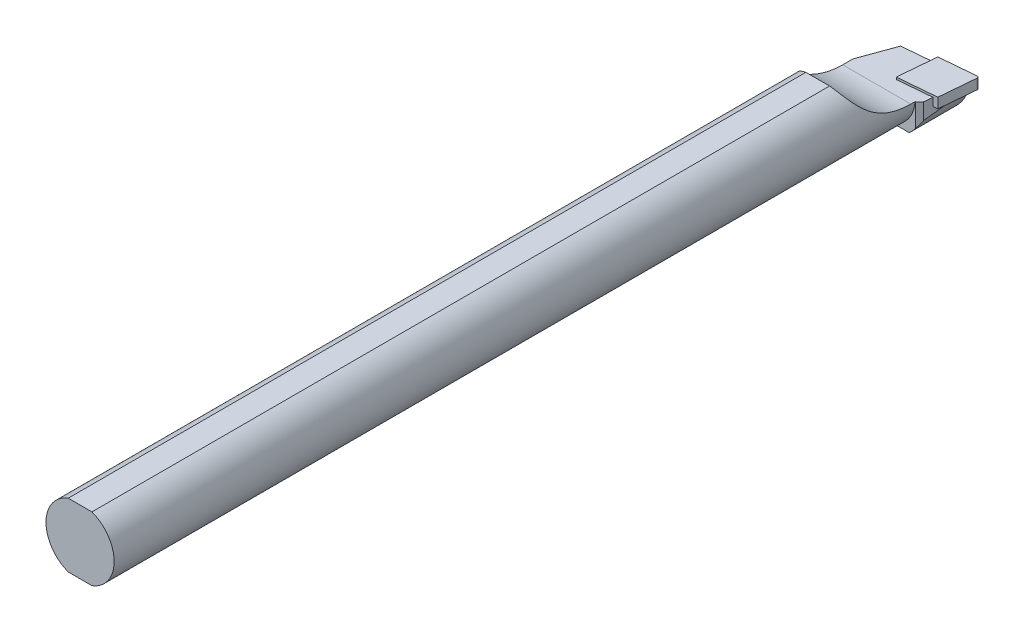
from build123d import *

# Parameters (mm, degrees)
ESQUISSE4_W                  = 8
ESQUISSE4_H                  = 199
ENL_V_MAT_EXTRU_5_DEPTH      = 50
ENL_V_MAT_EXTRU_5_DEPTH_BACK = 50
ENL_V_MAT_EXTRU_6_DEPTH      = 50
ENL_V_MAT_EXTRU_6_DEPTH_BACK = 50
BOSS_EXTRU_1_DEPTH           = 7.5
ENL_V_MAT_EXTRU_9_DEPTH      = 50
BOSS_EXTRU_4_DEPTH           = 2.38
ESQUISSE10_W                 = 500
ESQUISSE10_H                 = 34.5
ESQUISSE10_H_2               = 39.5
ENL_V_MAT_EXTRU_10_DEPTH     = 40


with BuildPart() as part:
    # Esquisse4 → Base-R_volution (revolve)
    with BuildSketch(Plane(origin=(0, 0, 0), x_dir=(1, 0, 0), z_dir=(0, 1, 0)), mode=Mode.PRIVATE) as base_r_volution_sk:
        with Locations((-15, -100.5)):
            Rectangle(ESQUISSE4_W, ESQUISSE4_H)
    revolve(base_r_volution_sk.sketch.rotate(Axis((-11, 0, 200), (0, 0, -1)), 180), axis=Axis((-11, 0, 200), (0, 0, -1)))

    # Esquisse5 → Enl_v. mat.-Extru.5 (cut, two sides: drawn at the far end of the back side and taken through both)
    with BuildSketch(Plane(origin=(0, 0, 0), x_dir=(1, 0, 0), z_dir=(0, 1, 0)).offset(-ENL_V_MAT_EXTRU_5_DEPTH_BACK)):
        Polygon((-16, -2.403638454), (31.071939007, 1.714622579), (31.071939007, 3.714622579), (-46.633713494, 3.714622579), (-46.633713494, -34.367003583), (-27.633713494, -34.367003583), align=None)
    extrude(amount=ENL_V_MAT_EXTRU_5_DEPTH + ENL_V_MAT_EXTRU_5_DEPTH_BACK, mode=Mode.SUBTRACT)

    # Esquisse6 → Enl_v. mat.-Extru.6 (cut, two sides: drawn at the far end of the back side and taken through both)
    with BuildSketch(Plane(origin=(0, 0, 0), x_dir=(0, 0, -1), z_dir=(1, 0, 0)).offset(-ENL_V_MAT_EXTRU_6_DEPTH_BACK)):
        with BuildLine():
            Line((1, 15.5), (1, -0.5))
            Line((1, -0.5), (-13, -0.5))
            ThreePointArc((-13, -0.5), (-24.313708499, 4.186291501), (-29, 15.5))
            Line((-29, 15.5), (1, 15.5))
        make_face()
    extrude(amount=ENL_V_MAT_EXTRU_6_DEPTH + ENL_V_MAT_EXTRU_6_DEPTH_BACK, mode=Mode.SUBTRACT)

    # Esquisse7 → Boss.-Extru.1 (add)
    with BuildSketch(Plane(origin=(0, -0.5, 0), x_dir=(-1, 0, 0), z_dir=(0, 1, 0))):
        Polygon((1.100062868, 1.100062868), (11, 1.966195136), (11, 12), (2.909610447, 12), (1.971620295, 11.062009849), align=None)
    extrude(amount=-BOSS_EXTRU_1_DEPTH)

    # Esquisse8 → Enl_v. mat.-Extru.9 (cut)
    with BuildSketch(Plane.XY):
        with BuildLine():
            Line((-21, 0), (-47.186773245, 0))
            ThreePointArc((-47.186773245, 0), (-11, -36.186773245), (25.186773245, 0))
            Line((25.186773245, 0), (-1, 0))
            ThreePointArc((-1, 0), (-11, -10), (-21, 0))
        make_face()
    extrude(amount=ENL_V_MAT_EXTRU_9_DEPTH, mode=Mode.SUBTRACT)

    # EsqPlaquette → Boss.-Extru.4 (add)
    with BuildSketch(Plane(origin=(0, 0, 0), x_dir=(1, 0, 0), z_dir=(0, 1, 0))):
        with BuildLine():
            Line((-0.744376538, -8.925727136), (-9.710128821, -9.710128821))
            Line((-9.710128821, -9.710128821), (-8.925727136, -0.744376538))
            Line((-8.925727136, -0.744376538), (-0.434862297, -0.001522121))
            ThreePointArc((-0.434862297, -0.001522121), (-0.117157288, -0.117157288), (-0.001522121, -0.434862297))
            Line((-0.001522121, -0.434862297), (-0.744376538, -8.925727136))
        make_face()
    extrude(amount=-BOSS_EXTRU_4_DEPTH)

    # Esquisse10 → Enl_v. mat.-Extru.10 (cut)
    with BuildSketch(Plane(origin=(0, 0, 0), x_dir=(0, 0, -1), z_dir=(1, 0, 0))):
        with Locations((-244, 24.75)):
            Rectangle(ESQUISSE10_W, ESQUISSE10_H)
        with Locations((-244, -27.25)):
            Rectangle(ESQUISSE10_W, ESQUISSE10_H_2)
    extrude(amount=-ENL_V_MAT_EXTRU_10_DEPTH, mode=Mode.SUBTRACT)


solid = part.part
